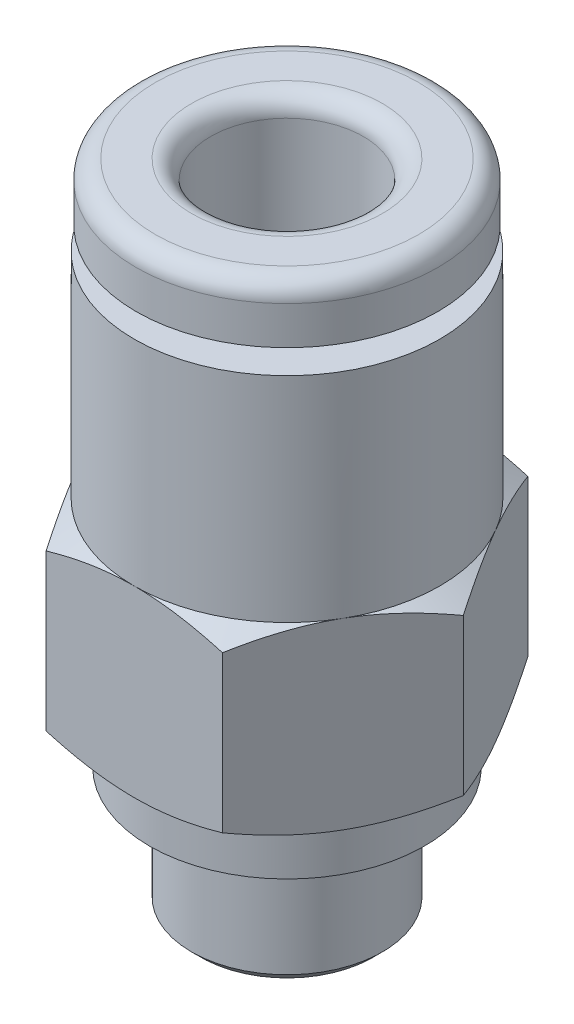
ISO-10303-21;
HEADER;
FILE_DESCRIPTION(('STEP AP214'),'2;1');
FILE_NAME('part.step','',(''),(''),'','','');
FILE_SCHEMA(('AUTOMOTIVE_DESIGN { 1 0 10303 214 1 1 1 1 }'));
ENDSEC;
DATA;
#1=APPLICATION_CONTEXT('core data for automotive mechanical design processes');
#2=APPLICATION_PROTOCOL_DEFINITION('international standard','automotive_design',2000,#1);
#3=PRODUCT_CONTEXT('',#1,'mechanical');
#4=PRODUCT('Part','Part','',(#3));
#5=PRODUCT_RELATED_PRODUCT_CATEGORY('part','',(#4));
#6=PRODUCT_DEFINITION_FORMATION('','',#4);
#7=PRODUCT_DEFINITION_CONTEXT('part definition',#1,'design');
#8=PRODUCT_DEFINITION('design','',#6,#7);
#9=PRODUCT_DEFINITION_SHAPE('','',#8);
#10=(LENGTH_UNIT() NAMED_UNIT(*) SI_UNIT(.MILLI.,.METRE.));
#11=(NAMED_UNIT(*) PLANE_ANGLE_UNIT() SI_UNIT($,.RADIAN.));
#12=(NAMED_UNIT(*) SI_UNIT($,.STERADIAN.) SOLID_ANGLE_UNIT());
#13=UNCERTAINTY_MEASURE_WITH_UNIT(LENGTH_MEASURE(1.E-05),#10,'distance_accuracy_value','');
#14=(GEOMETRIC_REPRESENTATION_CONTEXT(3) GLOBAL_UNCERTAINTY_ASSIGNED_CONTEXT((#13)) GLOBAL_UNIT_ASSIGNED_CONTEXT((#10,
#11,#12)) REPRESENTATION_CONTEXT('',''));
#15=CARTESIAN_POINT('',(0.,0.,0.));
#16=DIRECTION('',(0.,0.,1.));
#17=DIRECTION('',(1.,0.,0.));
#18=AXIS2_PLACEMENT_3D('',#15,#16,#17);
#19=CARTESIAN_POINT('',(0.,0.,0.));
#20=DIRECTION('',(0.,1.,0.));
#21=DIRECTION('',(0.,0.,1.));
#22=AXIS2_PLACEMENT_3D('',#19,#20,#21);
#23=CYLINDRICAL_SURFACE('',#22,2.2);
#24=CARTESIAN_POINT('',(0.,-2.10000000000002,0.));
#25=DIRECTION('',(0.,1.,0.));
#26=DIRECTION('',(0.,0.,1.));
#27=AXIS2_PLACEMENT_3D('',#24,#25,#26);
#28=CIRCLE('',#27,2.2);
#29=CARTESIAN_POINT('',(0.,-2.10000000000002,2.20000000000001));
#30=VERTEX_POINT('',#29);
#31=EDGE_CURVE('E245',#30,#30,#28,.F.);
#32=ORIENTED_EDGE('',*,*,#31,.F.);
#33=EDGE_LOOP('',(#32));
#34=FACE_BOUND('',#33,.T.);
#35=CARTESIAN_POINT('',(0.,-1.5,0.));
#36=DIRECTION('',(0.,1.,0.));
#37=DIRECTION('',(0.,0.,1.));
#38=AXIS2_PLACEMENT_3D('',#35,#36,#37);
#39=CIRCLE('',#38,2.2);
#40=CARTESIAN_POINT('',(0.,-1.5,2.20000000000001));
#41=VERTEX_POINT('',#40);
#42=EDGE_CURVE('E258',#41,#41,#39,.T.);
#43=ORIENTED_EDGE('',*,*,#42,.F.);
#44=EDGE_LOOP('',(#43));
#45=FACE_BOUND('',#44,.T.);
#46=ADVANCED_FACE('F29',(#34,#45),#23,.T.);
#47=CARTESIAN_POINT('',(-3.95,-1.5,0.));
#48=DIRECTION('',(0.,-1.,0.));
#49=DIRECTION('',(0.,0.,-1.));
#50=AXIS2_PLACEMENT_3D('',#47,#48,#49);
#51=PLANE('',#50);
#52=ORIENTED_EDGE('',*,*,#42,.T.);
#53=EDGE_LOOP('',(#52));
#54=FACE_BOUND('',#53,.T.);
#55=CARTESIAN_POINT('',(0.,-1.5,0.));
#56=DIRECTION('',(0.,1.,0.));
#57=DIRECTION('',(0.,0.,1.));
#58=AXIS2_PLACEMENT_3D('',#55,#56,#57);
#59=CIRCLE('',#58,3.95);
#60=CARTESIAN_POINT('',(0.,-1.5,3.95000000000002));
#61=VERTEX_POINT('',#60);
#62=EDGE_CURVE('E255',#61,#61,#59,.T.);
#63=ORIENTED_EDGE('',*,*,#62,.F.);
#64=EDGE_LOOP('',(#63));
#65=FACE_BOUND('',#64,.T.);
#66=ADVANCED_FACE('F353',(#54,#65),#51,.T.);
#67=CARTESIAN_POINT('',(0.,0.,0.));
#68=DIRECTION('',(0.,1.,0.));
#69=DIRECTION('',(0.,0.,1.));
#70=AXIS2_PLACEMENT_3D('',#67,#68,#69);
#71=CYLINDRICAL_SURFACE('',#70,3.95);
#72=ORIENTED_EDGE('',*,*,#62,.T.);
#73=EDGE_LOOP('',(#72));
#74=FACE_BOUND('',#73,.T.);
#75=CARTESIAN_POINT('',(0.,-0.5,0.));
#76=DIRECTION('',(0.,1.,0.));
#77=DIRECTION('',(0.,0.,1.));
#78=AXIS2_PLACEMENT_3D('',#75,#76,#77);
#79=CIRCLE('',#78,3.95);
#80=CARTESIAN_POINT('',(0.,-0.5,3.95000000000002));
#81=VERTEX_POINT('',#80);
#82=EDGE_CURVE('E252',#81,#81,#79,.T.);
#83=ORIENTED_EDGE('',*,*,#82,.F.);
#84=EDGE_LOOP('',(#83));
#85=FACE_BOUND('',#84,.T.);
#86=ADVANCED_FACE('F358',(#74,#85),#71,.T.);
#87=CARTESIAN_POINT('',(0.,-0.5,0.));
#88=DIRECTION('',(0.,1.,0.));
#89=DIRECTION('',(0.,0.,1.));
#90=AXIS2_PLACEMENT_3D('',#87,#88,#89);
#91=TOROIDAL_SURFACE('',#90,3.45,0.5);
#92=ORIENTED_EDGE('',*,*,#82,.T.);
#93=EDGE_LOOP('',(#92));
#94=FACE_BOUND('',#93,.T.);
#95=CARTESIAN_POINT('',(0.,0.,0.));
#96=DIRECTION('',(0.,1.,0.));
#97=DIRECTION('',(0.,0.,1.));
#98=AXIS2_PLACEMENT_3D('',#95,#96,#97);
#99=CIRCLE('',#98,3.45);
#100=CARTESIAN_POINT('',(0.,0.,3.45000000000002));
#101=VERTEX_POINT('',#100);
#102=EDGE_CURVE('E249',#101,#101,#99,.T.);
#103=ORIENTED_EDGE('',*,*,#102,.F.);
#104=EDGE_LOOP('',(#103));
#105=FACE_BOUND('',#104,.T.);
#106=ADVANCED_FACE('F368',(#94,#105),#91,.T.);
#107=CARTESIAN_POINT('',(0.,0.,0.));
#108=DIRECTION('',(0.,1.,0.));
#109=DIRECTION('',(0.,0.,1.));
#110=AXIS2_PLACEMENT_3D('',#107,#108,#109);
#111=PLANE('',#110);
#112=CARTESIAN_POINT('',(0.,0.,0.));
#113=DIRECTION('',(0.,1.,0.));
#114=DIRECTION('',(0.,0.,1.));
#115=AXIS2_PLACEMENT_3D('',#112,#113,#114);
#116=CIRCLE('',#115,2.5);
#117=CARTESIAN_POINT('',(0.,0.,2.50000000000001));
#118=VERTEX_POINT('',#117);
#119=EDGE_CURVE('E11',#118,#118,#116,.F.);
#120=ORIENTED_EDGE('',*,*,#119,.T.);
#121=EDGE_LOOP('',(#120));
#122=FACE_BOUND('',#121,.T.);
#123=ORIENTED_EDGE('',*,*,#102,.T.);
#124=EDGE_LOOP('',(#123));
#125=FACE_BOUND('',#124,.T.);
#126=ADVANCED_FACE('F374',(#122,#125),#111,.T.);
#127=CARTESIAN_POINT('',(0.,-19.0137084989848,0.));
#128=DIRECTION('',(0.,1.,0.));
#129=DIRECTION('',(0.,0.,1.));
#130=AXIS2_PLACEMENT_3D('',#127,#128,#129);
#131=CYLINDRICAL_SURFACE('',#130,4.);
#132=CARTESIAN_POINT('',(0.,-7.70000000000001,0.));
#133=DIRECTION('',(0.,1.,0.));
#134=DIRECTION('',(0.,0.,1.));
#135=AXIS2_PLACEMENT_3D('',#132,#133,#134);
#136=CIRCLE('',#135,4.);
#137=CARTESIAN_POINT('',(0.,-7.70000000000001,3.99999999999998));
#138=VERTEX_POINT('',#137);
#139=CARTESIAN_POINT('',(-3.46410161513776,-7.70000000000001,2.00000000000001));
#140=VERTEX_POINT('',#139);
#141=EDGE_CURVE('E243',#138,#140,#136,.F.);
#142=ORIENTED_EDGE('',*,*,#141,.F.);
#143=CARTESIAN_POINT('',(3.46410161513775,-7.70000000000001,2.00000000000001));
#144=VERTEX_POINT('',#143);
#145=EDGE_CURVE('E242',#144,#138,#136,.F.);
#146=ORIENTED_EDGE('',*,*,#145,.F.);
#147=CARTESIAN_POINT('',(3.46410161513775,-7.70000000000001,-2.));
#148=VERTEX_POINT('',#147);
#149=EDGE_CURVE('E317',#148,#144,#136,.F.);
#150=ORIENTED_EDGE('',*,*,#149,.F.);
#151=CARTESIAN_POINT('',(0.,-7.70000000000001,-4.00000000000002));
#152=VERTEX_POINT('',#151);
#153=EDGE_CURVE('E322',#152,#148,#136,.F.);
#154=ORIENTED_EDGE('',*,*,#153,.F.);
#155=CARTESIAN_POINT('',(-3.46410161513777,-7.70000000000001,-2.00000000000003));
#156=VERTEX_POINT('',#155);
#157=EDGE_CURVE('E464',#156,#152,#136,.F.);
#158=ORIENTED_EDGE('',*,*,#157,.F.);
#159=EDGE_CURVE('E246',#140,#156,#136,.F.);
#160=ORIENTED_EDGE('',*,*,#159,.F.);
#161=EDGE_LOOP('',(#142,#146,#150,#154,#158,#160));
#162=FACE_BOUND('',#161,.T.);
#163=CARTESIAN_POINT('',(0.,-2.10000000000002,0.));
#164=DIRECTION('',(0.,1.,0.));
#165=DIRECTION('',(0.,0.,1.));
#166=AXIS2_PLACEMENT_3D('',#163,#164,#165);
#167=CIRCLE('',#166,4.);
#168=CARTESIAN_POINT('',(0.,-2.10000000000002,4.00000000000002));
#169=VERTEX_POINT('',#168);
#170=EDGE_CURVE('E230',#169,#169,#167,.T.);
#171=ORIENTED_EDGE('',*,*,#170,.F.);
#172=EDGE_LOOP('',(#171));
#173=FACE_BOUND('',#172,.T.);
#174=ADVANCED_FACE('F324',(#162,#173),#131,.T.);
#175=CARTESIAN_POINT('',(0.,-2.10000000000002,0.));
#176=DIRECTION('',(0.,1.,0.));
#177=DIRECTION('',(0.,0.,1.));
#178=AXIS2_PLACEMENT_3D('',#175,#176,#177);
#179=PLANE('',#178);
#180=ORIENTED_EDGE('',*,*,#31,.T.);
#181=EDGE_LOOP('',(#180));
#182=FACE_BOUND('',#181,.T.);
#183=ORIENTED_EDGE('',*,*,#170,.T.);
#184=EDGE_LOOP('',(#183));
#185=FACE_BOUND('',#184,.T.);
#186=ADVANCED_FACE('F278',(#182,#185),#179,.T.);
#187=CARTESIAN_POINT('',(0.,-9.4320508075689,0.));
#188=DIRECTION('',(0.,-1.,0.));
#189=DIRECTION('',(0.,0.,-1.));
#190=AXIS2_PLACEMENT_3D('',#187,#188,#189);
#191=CONICAL_SURFACE('',#190,7.,1.0471975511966);
#192=CARTESIAN_POINT('',(-2.30928560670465,-8.05733225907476,-4.0002));
#193=CARTESIAN_POINT('',(-2.41077174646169,-7.99871787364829,-3.82442084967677));
#194=CARTESIAN_POINT('',(-2.51313390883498,-7.94541032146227,-3.64712438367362));
#195=CARTESIAN_POINT('',(-2.7196307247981,-7.85236167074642,-3.28946140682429));
#196=CARTESIAN_POINT('',(-2.82376904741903,-7.81265348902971,-3.10908854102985));
#197=CARTESIAN_POINT('',(-3.03075510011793,-7.75084221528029,-2.75057818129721));
#198=CARTESIAN_POINT('',(-3.13357098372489,-7.7283277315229,-2.57249584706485));
#199=CARTESIAN_POINT('',(-3.33968651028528,-7.70145062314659,-2.2154932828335));
#200=CARTESIAN_POINT('',(-3.44298540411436,-7.69706574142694,-2.03657435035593));
#201=CARTESIAN_POINT('',(-3.63600352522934,-7.70619007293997,-1.70225715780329));
#202=CARTESIAN_POINT('',(-3.72575165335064,-7.717458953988,-1.54680884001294));
#203=CARTESIAN_POINT('',(-3.90466320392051,-7.7531739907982,-1.23692494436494));
#204=CARTESIAN_POINT('',(-3.99382600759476,-7.77763234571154,-1.08249043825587));
#205=CARTESIAN_POINT('',(-4.17310641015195,-7.83877606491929,-0.771967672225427));
#206=CARTESIAN_POINT('',(-4.26320131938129,-7.87572060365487,-0.615918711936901));
#207=CARTESIAN_POINT('',(-4.44204742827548,-7.95957007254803,-0.306148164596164));
#208=CARTESIAN_POINT('',(-4.53080091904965,-8.00645530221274,-0.152422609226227));
#209=CARTESIAN_POINT('',(-4.61891762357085,-8.05733225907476,0.000199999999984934));
#210=B_SPLINE_CURVE_WITH_KNOTS('',3,(#192,#193,#194,#195,#196,#197,#198,#199,#200,#201,#202,
#203,#204,#205,#206,#207,#208,#209),.UNSPECIFIED.,.F.,.F.,(4,2,2,2,2,2,2,2,4),(0.,
0.634047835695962,1.26961969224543,1.88946157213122,2.50854226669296,3.04757825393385,
3.58711366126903,4.13861653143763,4.68903648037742),.UNSPECIFIED.);
#211=CARTESIAN_POINT('',(-2.30940107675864,-8.05726558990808,-4.00000000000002));
#212=VERTEX_POINT('',#211);
#213=EDGE_CURVE('E288',#212,#156,#210,.T.);
#214=ORIENTED_EDGE('',*,*,#213,.T.);
#215=ORIENTED_EDGE('',*,*,#157,.T.);
#216=CARTESIAN_POINT('',(-6.31761832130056,-9.70770834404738,-3.99999999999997));
#217=CARTESIAN_POINT('',(-6.14192520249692,-9.62202819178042,-4.00000000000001));
#218=CARTESIAN_POINT('',(-5.96584084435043,-9.53713714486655,-4.00000000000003));
#219=CARTESIAN_POINT('',(-5.61268201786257,-9.36937488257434,-4.00000000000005));
#220=CARTESIAN_POINT('',(-5.43560740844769,-9.28650396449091,-4.00000000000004));
#221=CARTESIAN_POINT('',(-5.07940162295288,-9.12283072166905,-4.00000000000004));
#222=CARTESIAN_POINT('',(-4.9002645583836,-9.04204116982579,-4.00000000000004));
#223=CARTESIAN_POINT('',(-4.54060511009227,-8.88361887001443,-4.00000000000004));
#224=CARTESIAN_POINT('',(-4.36008278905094,-8.80598598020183,-4.00000000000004));
#225=CARTESIAN_POINT('',(-3.99110781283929,-8.65209649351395,-4.00000000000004));
#226=CARTESIAN_POINT('',(-3.80259647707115,-8.57597985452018,-4.00000000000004));
#227=CARTESIAN_POINT('',(-3.42341084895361,-8.42923550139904,-4.00000000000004));
#228=CARTESIAN_POINT('',(-3.23273632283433,-8.35860838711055,-4.00000000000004));
#229=CARTESIAN_POINT('',(-2.84924251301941,-8.22461400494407,-4.00000000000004));
#230=CARTESIAN_POINT('',(-2.65642808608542,-8.16123297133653,-4.00000000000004));
#231=CARTESIAN_POINT('',(-2.26803531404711,-8.04368868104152,-4.00000000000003));
#232=CARTESIAN_POINT('',(-2.07245782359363,-7.98952263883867,-4.00000000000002));
#233=CARTESIAN_POINT('',(-1.6795415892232,-7.893227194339,-4.00000000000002));
#234=CARTESIAN_POINT('',(-1.48222021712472,-7.8510281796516,-4.00000000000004));
#235=CARTESIAN_POINT('',(-1.08500777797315,-7.78096546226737,-4.00000000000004));
#236=CARTESIAN_POINT('',(-0.885116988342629,-7.75310022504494,-4.00000000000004));
#237=CARTESIAN_POINT('',(-0.486419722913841,-7.71428669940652,-4.00000000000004));
#238=CARTESIAN_POINT('',(-0.287635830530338,-7.70311216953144,-4.00000000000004));
#239=CARTESIAN_POINT('',(0.110173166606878,-7.69802409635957,-4.00000000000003));
#240=CARTESIAN_POINT('',(0.309198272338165,-7.70411062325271,-4.00000000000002));
#241=CARTESIAN_POINT('',(0.643785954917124,-7.72841179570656,-4.00000000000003));
#242=CARTESIAN_POINT('',(0.779690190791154,-7.74222784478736,-4.00000000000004));
#243=CARTESIAN_POINT('',(1.05057142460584,-7.77710808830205,-4.00000000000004));
#244=CARTESIAN_POINT('',(1.18554830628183,-7.79817317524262,-4.00000000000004));
#245=CARTESIAN_POINT('',(1.58887088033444,-7.87114189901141,-4.00000000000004));
#246=CARTESIAN_POINT('',(1.85547379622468,-7.93280785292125,-4.00000000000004));
#247=CARTESIAN_POINT('',(2.25427403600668,-8.04059912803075,-4.00000000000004));
#248=CARTESIAN_POINT('',(2.38851478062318,-8.07960281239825,-4.00000000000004));
#249=CARTESIAN_POINT('',(2.65569482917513,-8.16187740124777,-4.00000000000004));
#250=CARTESIAN_POINT('',(2.78863412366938,-8.20514833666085,-4.00000000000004));
#251=CARTESIAN_POINT('',(3.05324930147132,-8.29524531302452,-4.00000000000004));
#252=CARTESIAN_POINT('',(3.18492553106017,-8.34207034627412,-4.00000000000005));
#253=CARTESIAN_POINT('',(3.44717271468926,-8.43870323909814,-4.00000000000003));
#254=CARTESIAN_POINT('',(3.57774368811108,-8.48851104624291,-4.));
#255=CARTESIAN_POINT('',(3.90838583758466,-8.61828112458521,-3.99999999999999));
#256=CARTESIAN_POINT('',(4.10778247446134,-8.69995980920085,-4.00000000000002));
#257=CARTESIAN_POINT('',(4.50466534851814,-8.86784881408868,-4.00000000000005));
#258=CARTESIAN_POINT('',(4.70215141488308,-8.95405953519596,-4.00000000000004));
#259=CARTESIAN_POINT('',(5.09560571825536,-9.13001548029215,-4.00000000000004));
#260=CARTESIAN_POINT('',(5.29157350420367,-9.21976170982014,-4.00000000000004));
#261=CARTESIAN_POINT('',(5.68222178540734,-9.40201823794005,-4.00000000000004));
#262=CARTESIAN_POINT('',(5.87690224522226,-9.49452861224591,-4.00000000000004));
#263=CARTESIAN_POINT('',(6.45989965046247,-9.77558165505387,-4.00000000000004));
#264=CARTESIAN_POINT('',(6.84663497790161,-9.96740176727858,-4.00000000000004));
#265=CARTESIAN_POINT('',(7.61714397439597,-10.3566974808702,-4.00000000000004));
#266=CARTESIAN_POINT('',(8.00091813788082,-10.5541721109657,-4.00000000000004));
#267=CARTESIAN_POINT('',(8.72975807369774,-10.9339590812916,-4.00000000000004));
#268=CARTESIAN_POINT('',(9.07501124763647,-11.1159124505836,-4.00000000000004));
#269=CARTESIAN_POINT('',(9.76427122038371,-11.4822021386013,-4.00000000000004));
#270=CARTESIAN_POINT('',(10.1082779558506,-11.6665385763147,-4.00000000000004));
#271=CARTESIAN_POINT('',(10.7942722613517,-12.0364316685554,-4.00000000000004));
#272=CARTESIAN_POINT('',(11.1362627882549,-12.2219828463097,-4.00000000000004));
#273=CARTESIAN_POINT('',(11.819458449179,-12.5944698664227,-4.00000000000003));
#274=CARTESIAN_POINT('',(12.1606636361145,-12.7814056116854,-4.00000000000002));
#275=CARTESIAN_POINT('',(12.5015869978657,-12.9688502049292,-4.));
#276=B_SPLINE_CURVE_WITH_KNOTS('',3,(#216,#217,#218,#219,#220,#221,#222,#223,#224,#225,#226,
#227,#228,#229,#230,#231,#232,#233,#234,#235,#236,#237,#238,#239,#240,#241,#242,#243,#244,#245,
#246,#247,#248,#249,#250,#251,#252,#253,#254,#255,#256,#257,#258,#259,#260,#261,#262,#263,#264,
#265,#266,#267,#268,#269,#270,#271,#272,#273,#274,#275),.UNSPECIFIED.,.F.,.F.,(4,2,2,2,2,2,2,2,
2,2,2,2,2,2,2,2,2,2,2,2,2,2,2,2,2,2,2,2,2,4),(0.,0.586421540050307,1.17292886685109,
1.76244097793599,2.3519265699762,2.96175582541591,3.57165162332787,4.18036881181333,
4.7889016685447,5.39381845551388,5.99867046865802,6.59524689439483,7.19182574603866,
7.60144321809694,8.0111111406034,8.83085062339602,9.25018861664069,9.66952964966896,
10.0887522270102,10.5079674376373,11.1543192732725,11.8007283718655,12.4473226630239,
13.0939346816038,14.3889300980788,15.6837043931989,16.8544868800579,18.0253280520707,
19.1925780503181,20.3597469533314),.UNSPECIFIED.);
#277=EDGE_CURVE('E260',#152,#212,#276,.F.);
#278=ORIENTED_EDGE('',*,*,#277,.T.);
#279=EDGE_LOOP('',(#214,#215,#278));
#280=FACE_BOUND('',#279,.T.);
#281=ADVANCED_FACE('F175',(#280),#191,.T.);
#282=CARTESIAN_POINT('',(4.61891762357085,-8.05733225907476,0.00020000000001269));
#283=CARTESIAN_POINT('',(4.51743148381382,-7.9987178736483,-0.175579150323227));
#284=CARTESIAN_POINT('',(4.41506932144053,-7.94541032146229,-0.352875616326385));
#285=CARTESIAN_POINT('',(4.20857250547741,-7.85236167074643,-0.710538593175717));
#286=CARTESIAN_POINT('',(4.10443418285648,-7.81265348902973,-0.890911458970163));
#287=CARTESIAN_POINT('',(3.89744813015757,-7.7508422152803,-1.2494218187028));
#288=CARTESIAN_POINT('',(3.7946322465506,-7.72832773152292,-1.42750415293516));
#289=CARTESIAN_POINT('',(3.58851671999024,-7.7014506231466,-1.78450671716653));
#290=CARTESIAN_POINT('',(3.48521782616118,-7.69706574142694,-1.96342564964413));
#291=CARTESIAN_POINT('',(3.2921997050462,-7.70619007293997,-2.29774284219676));
#292=CARTESIAN_POINT('',(3.20245157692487,-7.71745895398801,-2.45319115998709));
#293=CARTESIAN_POINT('',(3.02354002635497,-7.75317399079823,-2.76307505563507));
#294=CARTESIAN_POINT('',(2.93437722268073,-7.77763234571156,-2.91750956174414));
#295=CARTESIAN_POINT('',(2.75509682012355,-7.83877606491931,-3.22803232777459));
#296=CARTESIAN_POINT('',(2.66500191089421,-7.87572060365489,-3.38408128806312));
#297=CARTESIAN_POINT('',(2.48615580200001,-7.95957007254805,-3.69385183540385));
#298=CARTESIAN_POINT('',(2.39740231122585,-8.00645530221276,-3.84757739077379));
#299=CARTESIAN_POINT('',(2.30928560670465,-8.05733225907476,-4.0002));
#300=B_SPLINE_CURVE_WITH_KNOTS('',3,(#282,#283,#284,#285,#286,#287,#288,#289,#290,#291,#292,
#293,#294,#295,#296,#297,#298,#299),.UNSPECIFIED.,.F.,.F.,(4,2,2,2,2,2,2,2,4),(0.,
0.634047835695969,1.26961969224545,1.88946157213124,2.50854226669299,3.04757825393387,
3.58711366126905,4.13861653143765,4.68903648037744),.UNSPECIFIED.);
#301=CARTESIAN_POINT('',(2.30940107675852,-8.05726558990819,-4.00000000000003));
#302=VERTEX_POINT('',#301);
#303=EDGE_CURVE('E282',#148,#302,#300,.T.);
#304=ORIENTED_EDGE('',*,*,#303,.T.);
#305=EDGE_CURVE('E265',#302,#152,#276,.F.);
#306=ORIENTED_EDGE('',*,*,#305,.T.);
#307=ORIENTED_EDGE('',*,*,#153,.T.);
#308=EDGE_LOOP('',(#304,#306,#307));
#309=FACE_BOUND('',#308,.T.);
#310=ADVANCED_FACE('F461',(#309),#191,.T.);
#311=CARTESIAN_POINT('',(-4.61891762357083,-8.05733225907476,-0.000199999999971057));
#312=CARTESIAN_POINT('',(-4.51743148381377,-7.99871787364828,0.175579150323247));
#313=CARTESIAN_POINT('',(-4.41506932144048,-7.94541032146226,0.352875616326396));
#314=CARTESIAN_POINT('',(-4.20857250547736,-7.8523616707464,0.710538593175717));
#315=CARTESIAN_POINT('',(-4.10443418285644,-7.8126534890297,0.89091145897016));
#316=CARTESIAN_POINT('',(-3.89744813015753,-7.75084221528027,1.24942181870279));
#317=CARTESIAN_POINT('',(-3.79463224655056,-7.72832773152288,1.42750415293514));
#318=CARTESIAN_POINT('',(-3.58851671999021,-7.70145062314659,1.78450671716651));
#319=CARTESIAN_POINT('',(-3.48521782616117,-7.69706574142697,1.96342564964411));
#320=CARTESIAN_POINT('',(-3.29219970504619,-7.70619007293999,2.29774284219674));
#321=CARTESIAN_POINT('',(-3.20245157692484,-7.717458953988,2.45319115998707));
#322=CARTESIAN_POINT('',(-3.02354002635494,-7.75317399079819,2.76307505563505));
#323=CARTESIAN_POINT('',(-2.9343772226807,-7.77763234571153,2.91750956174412));
#324=CARTESIAN_POINT('',(-2.75509682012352,-7.83877606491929,3.22803232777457));
#325=CARTESIAN_POINT('',(-2.66500191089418,-7.87572060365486,3.38408128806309));
#326=CARTESIAN_POINT('',(-2.48615580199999,-7.95957007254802,3.69385183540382));
#327=CARTESIAN_POINT('',(-2.39740231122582,-8.00645530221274,3.84757739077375));
#328=CARTESIAN_POINT('',(-2.30928560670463,-8.05733225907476,4.00019999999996));
#329=B_SPLINE_CURVE_WITH_KNOTS('',3,(#311,#312,#313,#314,#315,#316,#317,#318,#319,#320,#321,
#322,#323,#324,#325,#326,#327,#328),.UNSPECIFIED.,.F.,.F.,(4,2,2,2,2,2,2,2,4),(0.,
0.634047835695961,1.26961969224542,1.8894615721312,2.50854226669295,3.04757825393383,
3.587113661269,4.13861653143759,4.68903648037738),.UNSPECIFIED.);
#330=CARTESIAN_POINT('',(-4.618802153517,-8.05726558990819,0.));
#331=VERTEX_POINT('',#330);
#332=EDGE_CURVE('E292',#331,#140,#329,.T.);
#333=ORIENTED_EDGE('',*,*,#332,.T.);
#334=ORIENTED_EDGE('',*,*,#159,.T.);
#335=EDGE_CURVE('E297',#156,#331,#210,.T.);
#336=ORIENTED_EDGE('',*,*,#335,.T.);
#337=EDGE_LOOP('',(#333,#334,#336));
#338=FACE_BOUND('',#337,.T.);
#339=ADVANCED_FACE('F466',(#338),#191,.T.);
#340=CARTESIAN_POINT('',(-6.31761832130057,-9.70770834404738,4.00000000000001));
#341=CARTESIAN_POINT('',(-6.14192520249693,-9.62202819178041,3.99999999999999));
#342=CARTESIAN_POINT('',(-5.96584084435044,-9.53713714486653,3.99999999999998));
#343=CARTESIAN_POINT('',(-5.61268201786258,-9.36937488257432,3.99999999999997));
#344=CARTESIAN_POINT('',(-5.4356074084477,-9.28650396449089,3.99999999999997));
#345=CARTESIAN_POINT('',(-5.07940162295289,-9.12283072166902,3.99999999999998));
#346=CARTESIAN_POINT('',(-4.9002645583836,-9.04204116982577,3.99999999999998));
#347=CARTESIAN_POINT('',(-4.54060511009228,-8.8836188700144,3.99999999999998));
#348=CARTESIAN_POINT('',(-4.36008278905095,-8.8059859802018,3.99999999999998));
#349=CARTESIAN_POINT('',(-3.9911078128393,-8.65209649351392,3.99999999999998));
#350=CARTESIAN_POINT('',(-3.80259647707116,-8.57597985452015,3.99999999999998));
#351=CARTESIAN_POINT('',(-3.42341084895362,-8.42923550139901,3.99999999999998));
#352=CARTESIAN_POINT('',(-3.23273632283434,-8.35860838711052,3.99999999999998));
#353=CARTESIAN_POINT('',(-2.84924251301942,-8.22461400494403,3.99999999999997));
#354=CARTESIAN_POINT('',(-2.65642808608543,-8.16123297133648,3.99999999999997));
#355=CARTESIAN_POINT('',(-2.26803531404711,-8.0436886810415,3.99999999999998));
#356=CARTESIAN_POINT('',(-2.07245782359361,-7.98952263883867,3.99999999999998));
#357=CARTESIAN_POINT('',(-1.67954158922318,-7.893227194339,3.99999999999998));
#358=CARTESIAN_POINT('',(-1.48222021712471,-7.85102817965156,3.99999999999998));
#359=CARTESIAN_POINT('',(-1.08500777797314,-7.78096546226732,3.99999999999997));
#360=CARTESIAN_POINT('',(-0.88511698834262,-7.7531002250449,3.99999999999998));
#361=CARTESIAN_POINT('',(-0.48641972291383,-7.71428669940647,3.99999999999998));
#362=CARTESIAN_POINT('',(-0.287635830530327,-7.70311216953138,3.99999999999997));
#363=CARTESIAN_POINT('',(0.110173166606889,-7.69802409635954,3.99999999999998));
#364=CARTESIAN_POINT('',(0.309198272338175,-7.70411062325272,3.99999999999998));
#365=CARTESIAN_POINT('',(0.64378595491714,-7.72841179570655,3.99999999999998));
#366=CARTESIAN_POINT('',(0.779690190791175,-7.74222784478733,3.99999999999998));
#367=CARTESIAN_POINT('',(1.05057142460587,-7.777108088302,3.99999999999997));
#368=CARTESIAN_POINT('',(1.18554830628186,-7.79817317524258,3.99999999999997));
#369=CARTESIAN_POINT('',(1.58887088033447,-7.87114189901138,3.99999999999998));
#370=CARTESIAN_POINT('',(1.85547379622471,-7.93280785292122,3.99999999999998));
#371=CARTESIAN_POINT('',(2.25427403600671,-8.04059912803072,3.99999999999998));
#372=CARTESIAN_POINT('',(2.38851478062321,-8.07960281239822,3.99999999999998));
#373=CARTESIAN_POINT('',(2.65569482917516,-8.16187740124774,3.99999999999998));
#374=CARTESIAN_POINT('',(2.7886341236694,-8.20514833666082,3.99999999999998));
#375=CARTESIAN_POINT('',(3.05324930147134,-8.29524531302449,3.99999999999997));
#376=CARTESIAN_POINT('',(3.1849255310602,-8.34207034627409,3.99999999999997));
#377=CARTESIAN_POINT('',(3.44717271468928,-8.43870323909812,3.99999999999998));
#378=CARTESIAN_POINT('',(3.5777436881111,-8.48851104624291,3.99999999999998));
#379=CARTESIAN_POINT('',(3.90838583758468,-8.61828112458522,3.99999999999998));
#380=CARTESIAN_POINT('',(4.10778247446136,-8.69995980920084,3.99999999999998));
#381=CARTESIAN_POINT('',(4.50466534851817,-8.86784881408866,3.99999999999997));
#382=CARTESIAN_POINT('',(4.70215141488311,-8.95405953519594,3.99999999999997));
#383=CARTESIAN_POINT('',(5.09560571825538,-9.13001548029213,3.99999999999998));
#384=CARTESIAN_POINT('',(5.29157350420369,-9.21976170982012,3.99999999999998));
#385=CARTESIAN_POINT('',(5.68222178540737,-9.40201823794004,3.99999999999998));
#386=CARTESIAN_POINT('',(5.87690224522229,-9.4945286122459,3.99999999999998));
#387=CARTESIAN_POINT('',(6.45989965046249,-9.77558165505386,3.99999999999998));
#388=CARTESIAN_POINT('',(6.84663497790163,-9.96740176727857,3.99999999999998));
#389=CARTESIAN_POINT('',(7.61714397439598,-10.3566974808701,3.99999999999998));
#390=CARTESIAN_POINT('',(8.00091813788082,-10.5541721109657,3.99999999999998));
#391=CARTESIAN_POINT('',(8.72975807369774,-10.9339590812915,3.99999999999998));
#392=CARTESIAN_POINT('',(9.07501124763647,-11.1159124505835,3.99999999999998));
#393=CARTESIAN_POINT('',(9.7642712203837,-11.4822021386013,3.99999999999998));
#394=CARTESIAN_POINT('',(10.1082779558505,-11.6665385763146,3.99999999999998));
#395=CARTESIAN_POINT('',(10.7942722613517,-12.0364316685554,3.99999999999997));
#396=CARTESIAN_POINT('',(11.1362627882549,-12.2219828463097,3.99999999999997));
#397=CARTESIAN_POINT('',(11.819458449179,-12.5944698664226,3.99999999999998));
#398=CARTESIAN_POINT('',(12.1606636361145,-12.7814056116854,3.99999999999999));
#399=CARTESIAN_POINT('',(12.5015869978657,-12.9688502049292,4.00000000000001));
#400=B_SPLINE_CURVE_WITH_KNOTS('',3,(#340,#341,#342,#343,#344,#345,#346,#347,#348,#349,#350,
#351,#352,#353,#354,#355,#356,#357,#358,#359,#360,#361,#362,#363,#364,#365,#366,#367,#368,#369,
#370,#371,#372,#373,#374,#375,#376,#377,#378,#379,#380,#381,#382,#383,#384,#385,#386,#387,#388,
#389,#390,#391,#392,#393,#394,#395,#396,#397,#398,#399),.UNSPECIFIED.,.F.,.F.,(4,2,2,2,2,2,2,2,
2,2,2,2,2,2,2,2,2,2,2,2,2,2,2,2,2,2,2,2,2,4),(0.,0.586421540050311,1.1729288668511,
1.762440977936,2.35192656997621,2.96175582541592,3.57165162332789,4.18036881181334,
4.78890166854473,5.39381845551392,5.99867046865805,6.59524689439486,7.1918257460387,
7.60144321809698,8.01111114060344,8.83085062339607,9.25018861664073,9.669529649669,
10.0887522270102,10.5079674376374,11.1543192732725,11.8007283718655,12.447322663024,
13.0939346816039,14.3889300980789,15.683704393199,16.8544868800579,18.0253280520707,
19.1925780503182,20.3597469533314),.UNSPECIFIED.);
#401=CARTESIAN_POINT('',(-2.30940107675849,-8.05726558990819,4.00000000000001));
#402=VERTEX_POINT('',#401);
#403=EDGE_CURVE('E221',#402,#138,#400,.T.);
#404=ORIENTED_EDGE('',*,*,#403,.T.);
#405=ORIENTED_EDGE('',*,*,#141,.T.);
#406=EDGE_CURVE('E222',#140,#402,#329,.T.);
#407=ORIENTED_EDGE('',*,*,#406,.T.);
#408=EDGE_LOOP('',(#404,#405,#407));
#409=FACE_BOUND('',#408,.T.);
#410=ADVANCED_FACE('F328',(#409),#191,.T.);
#411=CARTESIAN_POINT('',(2.30940107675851,-8.05726558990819,4.00000000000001));
#412=VERTEX_POINT('',#411);
#413=EDGE_CURVE('E214',#138,#412,#400,.T.);
#414=ORIENTED_EDGE('',*,*,#413,.T.);
#415=CARTESIAN_POINT('',(2.30928560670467,-8.05733225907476,4.00019999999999));
#416=CARTESIAN_POINT('',(2.41077174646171,-7.99871787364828,3.82442084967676));
#417=CARTESIAN_POINT('',(2.513133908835,-7.94541032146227,3.6471243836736));
#418=CARTESIAN_POINT('',(2.71963072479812,-7.85236167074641,3.28946140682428));
#419=CARTESIAN_POINT('',(2.82376904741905,-7.81265348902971,3.10908854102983));
#420=CARTESIAN_POINT('',(3.03075510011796,-7.75084221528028,2.75057818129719));
#421=CARTESIAN_POINT('',(3.13357098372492,-7.72832773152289,2.57249584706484));
#422=CARTESIAN_POINT('',(3.33968651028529,-7.70145062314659,2.21549328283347));
#423=CARTESIAN_POINT('',(3.44298540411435,-7.69706574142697,2.03657435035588));
#424=CARTESIAN_POINT('',(3.63600352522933,-7.70619007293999,1.70225715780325));
#425=CARTESIAN_POINT('',(3.72575165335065,-7.71745895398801,1.54680884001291));
#426=CARTESIAN_POINT('',(3.90466320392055,-7.7531739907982,1.23692494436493));
#427=CARTESIAN_POINT('',(3.99382600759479,-7.77763234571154,1.08249043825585));
#428=CARTESIAN_POINT('',(4.17310641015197,-7.8387760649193,0.771967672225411));
#429=CARTESIAN_POINT('',(4.26320131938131,-7.87572060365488,0.615918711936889));
#430=CARTESIAN_POINT('',(4.4420474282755,-7.95957007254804,0.306148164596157));
#431=CARTESIAN_POINT('',(4.53080091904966,-8.00645530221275,0.15242260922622));
#432=CARTESIAN_POINT('',(4.61891762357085,-8.05733225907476,-0.000199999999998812));
#433=B_SPLINE_CURVE_WITH_KNOTS('',3,(#415,#416,#417,#418,#419,#420,#421,#422,#423,#424,#425,
#426,#427,#428,#429,#430,#431,#432),.UNSPECIFIED.,.F.,.F.,(4,2,2,2,2,2,2,2,4),(0.,
0.634047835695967,1.26961969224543,1.88946157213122,2.50854226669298,3.04757825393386,
3.58711366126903,4.13861653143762,4.68903648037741),.UNSPECIFIED.);
#434=EDGE_CURVE('E303',#412,#144,#433,.T.);
#435=ORIENTED_EDGE('',*,*,#434,.T.);
#436=ORIENTED_EDGE('',*,*,#145,.T.);
#437=EDGE_LOOP('',(#414,#435,#436));
#438=FACE_BOUND('',#437,.T.);
#439=ADVANCED_FACE('F311',(#438),#191,.T.);
#440=CARTESIAN_POINT('',(4.61880215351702,-8.05726558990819,0.));
#441=VERTEX_POINT('',#440);
#442=EDGE_CURVE('E223',#144,#441,#433,.T.);
#443=ORIENTED_EDGE('',*,*,#442,.T.);
#444=EDGE_CURVE('E287',#441,#148,#300,.T.);
#445=ORIENTED_EDGE('',*,*,#444,.T.);
#446=ORIENTED_EDGE('',*,*,#149,.T.);
#447=EDGE_LOOP('',(#443,#445,#446));
#448=FACE_BOUND('',#447,.T.);
#449=ADVANCED_FACE('F270',(#448),#191,.T.);
#450=CARTESIAN_POINT('',(2.30940107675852,-24.7202018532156,-4.00000000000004));
#451=DIRECTION('',(0.,0.,-1.));
#452=DIRECTION('',(-1.,0.,0.));
#453=AXIS2_PLACEMENT_3D('',#450,#451,#452);
#454=PLANE('',#453);
#455=CARTESIAN_POINT('',(-6.31761832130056,-10.4922916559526,-3.99999999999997));
#456=CARTESIAN_POINT('',(-6.14192520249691,-10.5779718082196,-4.00000000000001));
#457=CARTESIAN_POINT('',(-5.96584084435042,-10.6628628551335,-4.00000000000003));
#458=CARTESIAN_POINT('',(-5.61268201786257,-10.8306251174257,-4.00000000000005));
#459=CARTESIAN_POINT('',(-5.43560740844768,-10.9134960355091,-4.00000000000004));
#460=CARTESIAN_POINT('',(-5.07940162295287,-11.077169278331,-4.00000000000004));
#461=CARTESIAN_POINT('',(-4.90026455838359,-11.1579588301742,-4.00000000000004));
#462=CARTESIAN_POINT('',(-4.54060511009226,-11.3163811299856,-4.00000000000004));
#463=CARTESIAN_POINT('',(-4.36008278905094,-11.3940140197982,-4.00000000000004));
#464=CARTESIAN_POINT('',(-3.99110781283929,-11.547903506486,-4.00000000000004));
#465=CARTESIAN_POINT('',(-3.80259647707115,-11.6240201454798,-4.00000000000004));
#466=CARTESIAN_POINT('',(-3.42341084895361,-11.770764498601,-4.00000000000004));
#467=CARTESIAN_POINT('',(-3.23273632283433,-11.8413916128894,-4.00000000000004));
#468=CARTESIAN_POINT('',(-2.84924251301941,-11.9753859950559,-4.00000000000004));
#469=CARTESIAN_POINT('',(-2.65642808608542,-12.0387670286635,-4.00000000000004));
#470=CARTESIAN_POINT('',(-2.26803531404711,-12.1563113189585,-4.00000000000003));
#471=CARTESIAN_POINT('',(-2.07245782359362,-12.2104773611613,-4.00000000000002));
#472=CARTESIAN_POINT('',(-1.6795415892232,-12.306772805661,-4.00000000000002));
#473=CARTESIAN_POINT('',(-1.48222021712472,-12.3489718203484,-4.00000000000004));
#474=CARTESIAN_POINT('',(-1.08500777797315,-12.4190345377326,-4.00000000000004));
#475=CARTESIAN_POINT('',(-0.885116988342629,-12.4468997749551,-4.00000000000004));
#476=CARTESIAN_POINT('',(-0.48641972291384,-12.4857133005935,-4.00000000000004));
#477=CARTESIAN_POINT('',(-0.287635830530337,-12.4968878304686,-4.00000000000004));
#478=CARTESIAN_POINT('',(0.110173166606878,-12.5019759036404,-4.00000000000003));
#479=CARTESIAN_POINT('',(0.309198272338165,-12.4958893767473,-4.00000000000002));
#480=CARTESIAN_POINT('',(0.643785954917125,-12.4715882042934,-4.00000000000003));
#481=CARTESIAN_POINT('',(0.779690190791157,-12.4577721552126,-4.00000000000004));
#482=CARTESIAN_POINT('',(1.05057142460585,-12.4228919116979,-4.00000000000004));
#483=CARTESIAN_POINT('',(1.18554830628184,-12.4018268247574,-4.00000000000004));
#484=CARTESIAN_POINT('',(1.58887088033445,-12.3288581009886,-4.00000000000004));
#485=CARTESIAN_POINT('',(1.85547379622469,-12.2671921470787,-4.00000000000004));
#486=CARTESIAN_POINT('',(2.2542740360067,-12.1594008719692,-4.00000000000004));
#487=CARTESIAN_POINT('',(2.3885147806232,-12.1203971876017,-4.00000000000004));
#488=CARTESIAN_POINT('',(2.65569482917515,-12.0381225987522,-4.00000000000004));
#489=CARTESIAN_POINT('',(2.7886341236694,-11.9948516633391,-4.00000000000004));
#490=CARTESIAN_POINT('',(3.05324930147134,-11.9047546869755,-4.00000000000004));
#491=CARTESIAN_POINT('',(3.1849255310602,-11.8579296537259,-4.00000000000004));
#492=CARTESIAN_POINT('',(3.44717271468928,-11.7612967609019,-4.00000000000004));
#493=CARTESIAN_POINT('',(3.5777436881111,-11.7114889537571,-4.00000000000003));
#494=CARTESIAN_POINT('',(3.90838583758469,-11.5817188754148,-4.00000000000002));
#495=CARTESIAN_POINT('',(4.10778247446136,-11.5000401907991,-4.00000000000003));
#496=CARTESIAN_POINT('',(4.50466534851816,-11.3321511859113,-4.00000000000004));
#497=CARTESIAN_POINT('',(4.7021514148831,-11.245940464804,-4.00000000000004));
#498=CARTESIAN_POINT('',(5.09560571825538,-11.0699845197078,-4.00000000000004));
#499=CARTESIAN_POINT('',(5.29157350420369,-10.9802382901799,-4.00000000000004));
#500=CARTESIAN_POINT('',(5.68222178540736,-10.7979817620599,-4.00000000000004));
#501=CARTESIAN_POINT('',(5.87690224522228,-10.7054713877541,-4.00000000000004));
#502=CARTESIAN_POINT('',(6.45989965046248,-10.4244183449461,-4.00000000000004));
#503=CARTESIAN_POINT('',(6.84663497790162,-10.2325982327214,-4.00000000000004));
#504=CARTESIAN_POINT('',(7.61714397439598,-9.84330251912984,-4.00000000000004));
#505=CARTESIAN_POINT('',(8.00091813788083,-9.64582788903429,-4.00000000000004));
#506=CARTESIAN_POINT('',(8.72975807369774,-9.26604091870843,-4.00000000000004));
#507=CARTESIAN_POINT('',(9.07501124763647,-9.08408754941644,-4.00000000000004));
#508=CARTESIAN_POINT('',(9.76427122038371,-8.71779786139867,-4.00000000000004));
#509=CARTESIAN_POINT('',(10.1082779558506,-8.53346142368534,-4.00000000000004));
#510=CARTESIAN_POINT('',(10.7942722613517,-8.16356833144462,-4.00000000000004));
#511=CARTESIAN_POINT('',(11.1362627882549,-7.97801715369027,-4.00000000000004));
#512=CARTESIAN_POINT('',(11.819458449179,-7.60553013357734,-4.00000000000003));
#513=CARTESIAN_POINT('',(12.1606636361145,-7.41859438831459,-4.00000000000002));
#514=CARTESIAN_POINT('',(12.5015869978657,-7.23114979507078,-4.));
#515=B_SPLINE_CURVE_WITH_KNOTS('',3,(#455,#456,#457,#458,#459,#460,#461,#462,#463,#464,#465,
#466,#467,#468,#469,#470,#471,#472,#473,#474,#475,#476,#477,#478,#479,#480,#481,#482,#483,#484,
#485,#486,#487,#488,#489,#490,#491,#492,#493,#494,#495,#496,#497,#498,#499,#500,#501,#502,#503,
#504,#505,#506,#507,#508,#509,#510,#511,#512,#513,#514),.UNSPECIFIED.,.F.,.F.,(4,2,2,2,2,2,2,2,
2,2,2,2,2,2,2,2,2,2,2,2,2,2,2,2,2,2,2,2,2,4),(0.,0.586421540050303,1.17292886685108,
1.76244097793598,2.3519265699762,2.9617558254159,3.57165162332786,4.18036881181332,
4.78890166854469,5.39381845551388,5.99867046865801,6.59524689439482,7.19182574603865,
7.60144321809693,8.01111114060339,8.83085062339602,9.25018861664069,9.66952964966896,
10.0887522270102,10.5079674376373,11.1543192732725,11.8007283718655,12.4473226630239,
13.0939346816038,14.3889300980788,15.6837043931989,16.8544868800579,18.0253280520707,
19.1925780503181,20.3597469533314),.UNSPECIFIED.);
#516=CARTESIAN_POINT('',(-2.30940107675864,-12.1427344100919,-4.00000000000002));
#517=VERTEX_POINT('',#516);
#518=CARTESIAN_POINT('',(0.,-12.5,-4.00000000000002));
#519=VERTEX_POINT('',#518);
#520=EDGE_CURVE('E455',#517,#519,#515,.T.);
#521=ORIENTED_EDGE('',*,*,#520,.F.);
#522=DIRECTION('',(0.,1.,0.));
#523=VECTOR('',#522,1.);
#524=CARTESIAN_POINT('',(-2.30940107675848,-24.7202018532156,-4.));
#525=LINE('',#524,#523);
#526=EDGE_CURVE('E236',#517,#212,#525,.T.);
#527=ORIENTED_EDGE('',*,*,#526,.T.);
#528=ORIENTED_EDGE('',*,*,#277,.F.);
#529=ORIENTED_EDGE('',*,*,#305,.F.);
#530=DIRECTION('',(0.,1.,0.));
#531=VECTOR('',#530,1.);
#532=CARTESIAN_POINT('',(2.30940107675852,-24.7202018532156,-4.00000000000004));
#533=LINE('',#532,#531);
#534=CARTESIAN_POINT('',(2.30940107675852,-12.1427344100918,-4.00000000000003));
#535=VERTEX_POINT('',#534);
#536=EDGE_CURVE('E238',#535,#302,#533,.T.);
#537=ORIENTED_EDGE('',*,*,#536,.F.);
#538=EDGE_CURVE('E139',#519,#535,#515,.T.);
#539=ORIENTED_EDGE('',*,*,#538,.F.);
#540=EDGE_LOOP('',(#521,#527,#528,#529,#537,#539));
#541=FACE_BOUND('',#540,.T.);
#542=ADVANCED_FACE('F266',(#541),#454,.T.);
#543=CARTESIAN_POINT('',(-2.30940107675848,-24.7202018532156,-4.));
#544=DIRECTION('',(-0.866025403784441,0.,-0.500000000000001));
#545=DIRECTION('',(-0.500000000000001,0.,0.866025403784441));
#546=AXIS2_PLACEMENT_3D('',#543,#544,#545);
#547=PLANE('',#546);
#548=CARTESIAN_POINT('',(-4.61891762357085,-12.1426677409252,0.000199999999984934));
#549=CARTESIAN_POINT('',(-4.51743148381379,-12.2012821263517,-0.175579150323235));
#550=CARTESIAN_POINT('',(-4.4150693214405,-12.2545896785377,-0.352875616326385));
#551=CARTESIAN_POINT('',(-4.20857250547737,-12.3476383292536,-0.710538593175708));
#552=CARTESIAN_POINT('',(-4.10443418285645,-12.3873465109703,-0.890911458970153));
#553=CARTESIAN_POINT('',(-3.89744813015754,-12.4491577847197,-1.24942181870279));
#554=CARTESIAN_POINT('',(-3.79463224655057,-12.4716722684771,-1.42750415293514));
#555=CARTESIAN_POINT('',(-3.58851671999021,-12.4985493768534,-1.78450671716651));
#556=CARTESIAN_POINT('',(-3.48521782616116,-12.5029342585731,-1.96342564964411));
#557=CARTESIAN_POINT('',(-3.29219970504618,-12.49380992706,-2.29774284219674));
#558=CARTESIAN_POINT('',(-3.20245157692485,-12.482541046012,-2.45319115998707));
#559=CARTESIAN_POINT('',(-3.02354002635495,-12.4468260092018,-2.76307505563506));
#560=CARTESIAN_POINT('',(-2.93437722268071,-12.4223676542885,-2.91750956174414));
#561=CARTESIAN_POINT('',(-2.75509682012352,-12.3612239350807,-3.22803232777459));
#562=CARTESIAN_POINT('',(-2.66500191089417,-12.3242793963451,-3.38408128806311));
#563=CARTESIAN_POINT('',(-2.48615580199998,-12.240429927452,-3.69385183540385));
#564=CARTESIAN_POINT('',(-2.39740231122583,-12.1935446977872,-3.8475773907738));
#565=CARTESIAN_POINT('',(-2.30928560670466,-12.1426677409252,-4.00020000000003));
#566=B_SPLINE_CURVE_WITH_KNOTS('',3,(#548,#549,#550,#551,#552,#553,#554,#555,#556,#557,#558,
#559,#560,#561,#562,#563,#564,#565),.UNSPECIFIED.,.F.,.F.,(4,2,2,2,2,2,2,2,4),(0.,
0.634047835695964,1.26961969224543,1.88946157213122,2.50854226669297,3.04757825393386,
3.58711366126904,4.13861653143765,4.68903648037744),.UNSPECIFIED.);
#567=CARTESIAN_POINT('',(-4.618802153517,-12.1427344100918,0.));
#568=VERTEX_POINT('',#567);
#569=CARTESIAN_POINT('',(-3.46410161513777,-12.5,-2.00000000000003));
#570=VERTEX_POINT('',#569);
#571=EDGE_CURVE('E145',#568,#570,#566,.T.);
#572=ORIENTED_EDGE('',*,*,#571,.F.);
#573=DIRECTION('',(0.,1.,0.));
#574=VECTOR('',#573,1.);
#575=CARTESIAN_POINT('',(-4.618802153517,-24.7202018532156,0.));
#576=LINE('',#575,#574);
#577=EDGE_CURVE('E234',#568,#331,#576,.T.);
#578=ORIENTED_EDGE('',*,*,#577,.T.);
#579=ORIENTED_EDGE('',*,*,#335,.F.);
#580=ORIENTED_EDGE('',*,*,#213,.F.);
#581=ORIENTED_EDGE('',*,*,#526,.F.);
#582=EDGE_CURVE('E190',#570,#517,#566,.T.);
#583=ORIENTED_EDGE('',*,*,#582,.F.);
#584=EDGE_LOOP('',(#572,#578,#579,#580,#581,#583));
#585=FACE_BOUND('',#584,.T.);
#586=ADVANCED_FACE('F269',(#585),#547,.T.);
#587=CARTESIAN_POINT('',(-4.618802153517,-24.7202018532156,0.));
#588=DIRECTION('',(-0.86602540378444,0.,0.500000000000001));
#589=DIRECTION('',(0.500000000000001,0.,0.86602540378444));
#590=AXIS2_PLACEMENT_3D('',#587,#588,#589);
#591=PLANE('',#590);
#592=CARTESIAN_POINT('',(-2.30928560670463,-12.1426677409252,4.00019999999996));
#593=CARTESIAN_POINT('',(-2.41077174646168,-12.2012821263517,3.82442084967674));
#594=CARTESIAN_POINT('',(-2.51313390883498,-12.2545896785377,3.6471243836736));
#595=CARTESIAN_POINT('',(-2.7196307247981,-12.3476383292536,3.28946140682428));
#596=CARTESIAN_POINT('',(-2.82376904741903,-12.3873465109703,3.10908854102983));
#597=CARTESIAN_POINT('',(-3.03075510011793,-12.4491577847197,2.75057818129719));
#598=CARTESIAN_POINT('',(-3.13357098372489,-12.4716722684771,2.57249584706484));
#599=CARTESIAN_POINT('',(-3.33968651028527,-12.4985493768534,2.21549328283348));
#600=CARTESIAN_POINT('',(-3.44298540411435,-12.5029342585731,2.0365743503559));
#601=CARTESIAN_POINT('',(-3.63600352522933,-12.49380992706,1.70225715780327));
#602=CARTESIAN_POINT('',(-3.72575165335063,-12.482541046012,1.54680884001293));
#603=CARTESIAN_POINT('',(-3.90466320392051,-12.4468260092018,1.23692494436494));
#604=CARTESIAN_POINT('',(-3.99382600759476,-12.4223676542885,1.08249043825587));
#605=CARTESIAN_POINT('',(-4.17310641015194,-12.3612239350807,0.771967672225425));
#606=CARTESIAN_POINT('',(-4.26320131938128,-12.3242793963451,0.615918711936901));
#607=CARTESIAN_POINT('',(-4.44204742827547,-12.240429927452,0.30614816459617));
#608=CARTESIAN_POINT('',(-4.53080091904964,-12.1935446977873,0.152422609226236));
#609=CARTESIAN_POINT('',(-4.61891762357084,-12.1426677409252,-0.000199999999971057));
#610=B_SPLINE_CURVE_WITH_KNOTS('',3,(#592,#593,#594,#595,#596,#597,#598,#599,#600,#601,#602,
#603,#604,#605,#606,#607,#608,#609),.UNSPECIFIED.,.F.,.F.,(4,2,2,2,2,2,2,2,4),(0.,
0.634047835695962,1.26961969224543,1.88946157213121,2.50854226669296,3.04757825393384,
3.58711366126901,4.1386165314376,4.68903648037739),.UNSPECIFIED.);
#611=CARTESIAN_POINT('',(-2.3094010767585,-12.1427344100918,3.99999999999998));
#612=VERTEX_POINT('',#611);
#613=CARTESIAN_POINT('',(-3.46410161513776,-12.5,2.00000000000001));
#614=VERTEX_POINT('',#613);
#615=EDGE_CURVE('E333',#612,#614,#610,.T.);
#616=ORIENTED_EDGE('',*,*,#615,.F.);
#617=DIRECTION('',(0.,1.,0.));
#618=VECTOR('',#617,1.);
#619=CARTESIAN_POINT('',(-2.3094010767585,-24.7202018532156,3.99999999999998));
#620=LINE('',#619,#618);
#621=EDGE_CURVE('E232',#612,#402,#620,.T.);
#622=ORIENTED_EDGE('',*,*,#621,.T.);
#623=ORIENTED_EDGE('',*,*,#406,.F.);
#624=ORIENTED_EDGE('',*,*,#332,.F.);
#625=ORIENTED_EDGE('',*,*,#577,.F.);
#626=EDGE_CURVE('E199',#614,#568,#610,.T.);
#627=ORIENTED_EDGE('',*,*,#626,.F.);
#628=EDGE_LOOP('',(#616,#622,#623,#624,#625,#627));
#629=FACE_BOUND('',#628,.T.);
#630=ADVANCED_FACE('F209',(#629),#591,.T.);
#631=CARTESIAN_POINT('',(-2.3094010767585,-24.7202018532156,3.99999999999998));
#632=DIRECTION('',(0.,0.,1.));
#633=DIRECTION('',(1.,0.,0.));
#634=AXIS2_PLACEMENT_3D('',#631,#632,#633);
#635=PLANE('',#634);
#636=CARTESIAN_POINT('',(-6.31761832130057,-10.4922916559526,4.00000000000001));
#637=CARTESIAN_POINT('',(-6.14192520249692,-10.5779718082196,3.99999999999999));
#638=CARTESIAN_POINT('',(-5.96584084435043,-10.6628628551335,3.99999999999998));
#639=CARTESIAN_POINT('',(-5.61268201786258,-10.8306251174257,3.99999999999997));
#640=CARTESIAN_POINT('',(-5.43560740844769,-10.9134960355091,3.99999999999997));
#641=CARTESIAN_POINT('',(-5.07940162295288,-11.077169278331,3.99999999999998));
#642=CARTESIAN_POINT('',(-4.9002645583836,-11.1579588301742,3.99999999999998));
#643=CARTESIAN_POINT('',(-4.54060511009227,-11.3163811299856,3.99999999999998));
#644=CARTESIAN_POINT('',(-4.36008278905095,-11.3940140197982,3.99999999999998));
#645=CARTESIAN_POINT('',(-3.9911078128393,-11.5479035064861,3.99999999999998));
#646=CARTESIAN_POINT('',(-3.80259647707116,-11.6240201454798,3.99999999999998));
#647=CARTESIAN_POINT('',(-3.42341084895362,-11.770764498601,3.99999999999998));
#648=CARTESIAN_POINT('',(-3.23273632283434,-11.8413916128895,3.99999999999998));
#649=CARTESIAN_POINT('',(-2.84924251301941,-11.975385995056,3.99999999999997));
#650=CARTESIAN_POINT('',(-2.65642808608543,-12.0387670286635,3.99999999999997));
#651=CARTESIAN_POINT('',(-2.26803531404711,-12.1563113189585,3.99999999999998));
#652=CARTESIAN_POINT('',(-2.07245782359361,-12.2104773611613,3.99999999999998));
#653=CARTESIAN_POINT('',(-1.67954158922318,-12.306772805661,3.99999999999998));
#654=CARTESIAN_POINT('',(-1.48222021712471,-12.3489718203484,3.99999999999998));
#655=CARTESIAN_POINT('',(-1.08500777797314,-12.4190345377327,3.99999999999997));
#656=CARTESIAN_POINT('',(-0.885116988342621,-12.4468997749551,3.99999999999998));
#657=CARTESIAN_POINT('',(-0.48641972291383,-12.4857133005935,3.99999999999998));
#658=CARTESIAN_POINT('',(-0.287635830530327,-12.4968878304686,3.99999999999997));
#659=CARTESIAN_POINT('',(0.110173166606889,-12.5019759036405,3.99999999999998));
#660=CARTESIAN_POINT('',(0.309198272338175,-12.4958893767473,3.99999999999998));
#661=CARTESIAN_POINT('',(0.64378595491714,-12.4715882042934,3.99999999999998));
#662=CARTESIAN_POINT('',(0.779690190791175,-12.4577721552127,3.99999999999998));
#663=CARTESIAN_POINT('',(1.05057142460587,-12.422891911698,3.99999999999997));
#664=CARTESIAN_POINT('',(1.18554830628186,-12.4018268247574,3.99999999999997));
#665=CARTESIAN_POINT('',(1.58887088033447,-12.3288581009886,3.99999999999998));
#666=CARTESIAN_POINT('',(1.85547379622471,-12.2671921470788,3.99999999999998));
#667=CARTESIAN_POINT('',(2.25427403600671,-12.1594008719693,3.99999999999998));
#668=CARTESIAN_POINT('',(2.38851478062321,-12.1203971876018,3.99999999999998));
#669=CARTESIAN_POINT('',(2.65569482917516,-12.0381225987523,3.99999999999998));
#670=CARTESIAN_POINT('',(2.7886341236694,-11.9948516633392,3.99999999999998));
#671=CARTESIAN_POINT('',(3.05324930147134,-11.9047546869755,3.99999999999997));
#672=CARTESIAN_POINT('',(3.1849255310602,-11.8579296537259,3.99999999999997));
#673=CARTESIAN_POINT('',(3.44717271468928,-11.7612967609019,3.99999999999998));
#674=CARTESIAN_POINT('',(3.5777436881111,-11.7114889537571,3.99999999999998));
#675=CARTESIAN_POINT('',(3.90838583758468,-11.5817188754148,3.99999999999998));
#676=CARTESIAN_POINT('',(4.10778247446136,-11.5000401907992,3.99999999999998));
#677=CARTESIAN_POINT('',(4.50466534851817,-11.3321511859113,3.99999999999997));
#678=CARTESIAN_POINT('',(4.70215141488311,-11.2459404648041,3.99999999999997));
#679=CARTESIAN_POINT('',(5.09560571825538,-11.0699845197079,3.99999999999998));
#680=CARTESIAN_POINT('',(5.2915735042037,-10.9802382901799,3.99999999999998));
#681=CARTESIAN_POINT('',(5.68222178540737,-10.79798176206,3.99999999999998));
#682=CARTESIAN_POINT('',(5.87690224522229,-10.7054713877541,3.99999999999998));
#683=CARTESIAN_POINT('',(6.45989965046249,-10.4244183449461,3.99999999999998));
#684=CARTESIAN_POINT('',(6.84663497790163,-10.2325982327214,3.99999999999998));
#685=CARTESIAN_POINT('',(7.61714397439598,-9.84330251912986,3.99999999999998));
#686=CARTESIAN_POINT('',(8.00091813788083,-9.64582788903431,3.99999999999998));
#687=CARTESIAN_POINT('',(8.72975807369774,-9.26604091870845,3.99999999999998));
#688=CARTESIAN_POINT('',(9.07501124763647,-9.08408754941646,3.99999999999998));
#689=CARTESIAN_POINT('',(9.7642712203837,-8.71779786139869,3.99999999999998));
#690=CARTESIAN_POINT('',(10.1082779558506,-8.53346142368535,3.99999999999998));
#691=CARTESIAN_POINT('',(10.7942722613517,-8.16356833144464,3.99999999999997));
#692=CARTESIAN_POINT('',(11.1362627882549,-7.9780171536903,3.99999999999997));
#693=CARTESIAN_POINT('',(11.819458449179,-7.60553013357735,3.99999999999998));
#694=CARTESIAN_POINT('',(12.1606636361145,-7.41859438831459,3.99999999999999));
#695=CARTESIAN_POINT('',(12.5015869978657,-7.23114979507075,4.00000000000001));
#696=B_SPLINE_CURVE_WITH_KNOTS('',3,(#636,#637,#638,#639,#640,#641,#642,#643,#644,#645,#646,
#647,#648,#649,#650,#651,#652,#653,#654,#655,#656,#657,#658,#659,#660,#661,#662,#663,#664,#665,
#666,#667,#668,#669,#670,#671,#672,#673,#674,#675,#676,#677,#678,#679,#680,#681,#682,#683,#684,
#685,#686,#687,#688,#689,#690,#691,#692,#693,#694,#695),.UNSPECIFIED.,.F.,.F.,(4,2,2,2,2,2,2,2,
2,2,2,2,2,2,2,2,2,2,2,2,2,2,2,2,2,2,2,2,2,4),(0.,0.586421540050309,1.17292886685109,
1.76244097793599,2.35192656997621,2.96175582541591,3.57165162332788,4.18036881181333,
4.78890166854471,5.3938184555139,5.99867046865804,6.59524689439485,7.19182574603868,
7.60144321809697,8.01111114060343,8.83085062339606,9.25018861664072,9.66952964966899,
10.0887522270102,10.5079674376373,11.1543192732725,11.8007283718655,12.447322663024,
13.0939346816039,14.3889300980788,15.683704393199,16.8544868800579,18.0253280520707,
19.1925780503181,20.3597469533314),.UNSPECIFIED.);
#697=CARTESIAN_POINT('',(2.30940107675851,-12.1427344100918,4.00000000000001));
#698=VERTEX_POINT('',#697);
#699=CARTESIAN_POINT('',(0.,-12.5,3.99999999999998));
#700=VERTEX_POINT('',#699);
#701=EDGE_CURVE('E123',#698,#700,#696,.F.);
#702=ORIENTED_EDGE('',*,*,#701,.F.);
#703=DIRECTION('',(0.,1.,0.));
#704=VECTOR('',#703,1.);
#705=CARTESIAN_POINT('',(2.3094010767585,-24.7202018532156,4.));
#706=LINE('',#705,#704);
#707=EDGE_CURVE('E144',#698,#412,#706,.T.);
#708=ORIENTED_EDGE('',*,*,#707,.T.);
#709=ORIENTED_EDGE('',*,*,#413,.F.);
#710=ORIENTED_EDGE('',*,*,#403,.F.);
#711=ORIENTED_EDGE('',*,*,#621,.F.);
#712=EDGE_CURVE('E200',#700,#612,#696,.F.);
#713=ORIENTED_EDGE('',*,*,#712,.F.);
#714=EDGE_LOOP('',(#702,#708,#709,#710,#711,#713));
#715=FACE_BOUND('',#714,.T.);
#716=ADVANCED_FACE('F206',(#715),#635,.T.);
#717=CARTESIAN_POINT('',(2.3094010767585,-24.7202018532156,4.));
#718=DIRECTION('',(0.86602540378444,0.,0.500000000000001));
#719=DIRECTION('',(0.500000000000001,0.,-0.866025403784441));
#720=AXIS2_PLACEMENT_3D('',#717,#718,#719);
#721=PLANE('',#720);
#722=CARTESIAN_POINT('',(4.61891762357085,-12.1426677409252,-0.000199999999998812));
#723=CARTESIAN_POINT('',(4.5174314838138,-12.2012821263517,0.175579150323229));
#724=CARTESIAN_POINT('',(4.41506932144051,-12.2545896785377,0.352875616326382));
#725=CARTESIAN_POINT('',(4.20857250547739,-12.3476383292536,0.710538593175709));
#726=CARTESIAN_POINT('',(4.10443418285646,-12.3873465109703,0.890911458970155));
#727=CARTESIAN_POINT('',(3.89744813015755,-12.4491577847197,1.24942181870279));
#728=CARTESIAN_POINT('',(3.79463224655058,-12.4716722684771,1.42750415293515));
#729=CARTESIAN_POINT('',(3.58851671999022,-12.4985493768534,1.78450671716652));
#730=CARTESIAN_POINT('',(3.48521782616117,-12.5029342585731,1.96342564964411));
#731=CARTESIAN_POINT('',(3.29219970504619,-12.49380992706,2.29774284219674));
#732=CARTESIAN_POINT('',(3.20245157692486,-12.482541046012,2.45319115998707));
#733=CARTESIAN_POINT('',(3.02354002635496,-12.4468260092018,2.76307505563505));
#734=CARTESIAN_POINT('',(2.93437722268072,-12.4223676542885,2.91750956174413));
#735=CARTESIAN_POINT('',(2.75509682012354,-12.3612239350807,3.22803232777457));
#736=CARTESIAN_POINT('',(2.6650019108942,-12.3242793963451,3.38408128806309));
#737=CARTESIAN_POINT('',(2.48615580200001,-12.240429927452,3.69385183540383));
#738=CARTESIAN_POINT('',(2.39740231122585,-12.1935446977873,3.84757739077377));
#739=CARTESIAN_POINT('',(2.30928560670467,-12.1426677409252,4.00019999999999));
#740=B_SPLINE_CURVE_WITH_KNOTS('',3,(#722,#723,#724,#725,#726,#727,#728,#729,#730,#731,#732,
#733,#734,#735,#736,#737,#738,#739),.UNSPECIFIED.,.F.,.F.,(4,2,2,2,2,2,2,2,4),(0.,
0.634047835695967,1.26961969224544,1.88946157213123,2.50854226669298,3.04757825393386,
3.58711366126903,4.13861653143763,4.68903648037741),.UNSPECIFIED.);
#741=CARTESIAN_POINT('',(4.61880215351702,-12.1427344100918,0.));
#742=VERTEX_POINT('',#741);
#743=CARTESIAN_POINT('',(3.46410161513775,-12.5,2.00000000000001));
#744=VERTEX_POINT('',#743);
#745=EDGE_CURVE('E128',#742,#744,#740,.T.);
#746=ORIENTED_EDGE('',*,*,#745,.F.);
#747=DIRECTION('',(0.,1.,0.));
#748=VECTOR('',#747,1.);
#749=CARTESIAN_POINT('',(4.61880215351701,-24.7202018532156,0.));
#750=LINE('',#749,#748);
#751=EDGE_CURVE('E228',#742,#441,#750,.T.);
#752=ORIENTED_EDGE('',*,*,#751,.T.);
#753=ORIENTED_EDGE('',*,*,#442,.F.);
#754=ORIENTED_EDGE('',*,*,#434,.F.);
#755=ORIENTED_EDGE('',*,*,#707,.F.);
#756=EDGE_CURVE('E121',#744,#698,#740,.T.);
#757=ORIENTED_EDGE('',*,*,#756,.F.);
#758=EDGE_LOOP('',(#746,#752,#753,#754,#755,#757));
#759=FACE_BOUND('',#758,.T.);
#760=ADVANCED_FACE('F142',(#759),#721,.T.);
#761=CARTESIAN_POINT('',(4.61880215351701,-24.7202018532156,0.));
#762=DIRECTION('',(0.86602540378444,0.,-0.500000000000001));
#763=DIRECTION('',(-0.500000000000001,0.,-0.86602540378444));
#764=AXIS2_PLACEMENT_3D('',#761,#762,#763);
#765=PLANE('',#764);
#766=CARTESIAN_POINT('',(2.30928560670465,-12.1426677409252,-4.0002));
#767=CARTESIAN_POINT('',(2.41077174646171,-12.2012821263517,-3.82442084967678));
#768=CARTESIAN_POINT('',(2.513133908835,-12.2545896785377,-3.64712438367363));
#769=CARTESIAN_POINT('',(2.71963072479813,-12.3476383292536,-3.28946140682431));
#770=CARTESIAN_POINT('',(2.82376904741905,-12.3873465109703,-3.10908854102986));
#771=CARTESIAN_POINT('',(3.03075510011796,-12.4491577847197,-2.75057818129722));
#772=CARTESIAN_POINT('',(3.13357098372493,-12.4716722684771,-2.57249584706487));
#773=CARTESIAN_POINT('',(3.3396865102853,-12.4985493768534,-2.2154932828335));
#774=CARTESIAN_POINT('',(3.44298540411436,-12.5029342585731,-2.03657435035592));
#775=CARTESIAN_POINT('',(3.63600352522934,-12.49380992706,-1.70225715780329));
#776=CARTESIAN_POINT('',(3.72575165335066,-12.482541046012,-1.54680884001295));
#777=CARTESIAN_POINT('',(3.90466320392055,-12.4468260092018,-1.23692494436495));
#778=CARTESIAN_POINT('',(3.9938260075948,-12.4223676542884,-1.08249043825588));
#779=CARTESIAN_POINT('',(4.17310641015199,-12.3612239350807,-0.771967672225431));
#780=CARTESIAN_POINT('',(4.26320131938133,-12.3242793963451,-0.615918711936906));
#781=CARTESIAN_POINT('',(4.44204742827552,-12.2404299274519,-0.306148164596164));
#782=CARTESIAN_POINT('',(4.53080091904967,-12.1935446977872,-0.152422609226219));
#783=CARTESIAN_POINT('',(4.61891762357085,-12.1426677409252,0.00020000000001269));
#784=B_SPLINE_CURVE_WITH_KNOTS('',3,(#766,#767,#768,#769,#770,#771,#772,#773,#774,#775,#776,
#777,#778,#779,#780,#781,#782,#783),.UNSPECIFIED.,.F.,.F.,(4,2,2,2,2,2,2,2,4),(0.,
0.634047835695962,1.26961969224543,1.88946157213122,2.50854226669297,3.04757825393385,
3.58711366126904,4.13861653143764,4.68903648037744),.UNSPECIFIED.);
#785=CARTESIAN_POINT('',(3.46410161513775,-12.5,-2.));
#786=VERTEX_POINT('',#785);
#787=EDGE_CURVE('E48',#535,#786,#784,.T.);
#788=ORIENTED_EDGE('',*,*,#787,.F.);
#789=ORIENTED_EDGE('',*,*,#536,.T.);
#790=ORIENTED_EDGE('',*,*,#303,.F.);
#791=ORIENTED_EDGE('',*,*,#444,.F.);
#792=ORIENTED_EDGE('',*,*,#751,.F.);
#793=EDGE_CURVE('E136',#786,#742,#784,.T.);
#794=ORIENTED_EDGE('',*,*,#793,.F.);
#795=EDGE_LOOP('',(#788,#789,#790,#791,#792,#794));
#796=FACE_BOUND('',#795,.T.);
#797=ADVANCED_FACE('F171',(#796),#765,.T.);
#798=CARTESIAN_POINT('',(0.,-12.5,0.));
#799=DIRECTION('',(0.,1.,0.));
#800=DIRECTION('',(0.,0.,1.));
#801=AXIS2_PLACEMENT_3D('',#798,#799,#800);
#802=CONICAL_SURFACE('',#801,4.,1.0471975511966);
#803=ORIENTED_EDGE('',*,*,#745,.T.);
#804=CARTESIAN_POINT('',(0.,-12.5,0.));
#805=DIRECTION('',(0.,1.,0.));
#806=DIRECTION('',(0.,0.,1.));
#807=AXIS2_PLACEMENT_3D('',#804,#805,#806);
#808=CIRCLE('',#807,4.);
#809=EDGE_CURVE('E129',#744,#786,#808,.T.);
#810=ORIENTED_EDGE('',*,*,#809,.T.);
#811=ORIENTED_EDGE('',*,*,#793,.T.);
#812=EDGE_LOOP('',(#803,#810,#811));
#813=FACE_BOUND('',#812,.T.);
#814=ADVANCED_FACE('F134',(#813),#802,.T.);
#815=ORIENTED_EDGE('',*,*,#538,.T.);
#816=ORIENTED_EDGE('',*,*,#787,.T.);
#817=EDGE_CURVE('E44',#786,#519,#808,.T.);
#818=ORIENTED_EDGE('',*,*,#817,.T.);
#819=EDGE_LOOP('',(#815,#816,#818));
#820=FACE_BOUND('',#819,.T.);
#821=ADVANCED_FACE('F170',(#820),#802,.T.);
#822=ORIENTED_EDGE('',*,*,#701,.T.);
#823=EDGE_CURVE('E117',#700,#744,#808,.T.);
#824=ORIENTED_EDGE('',*,*,#823,.T.);
#825=ORIENTED_EDGE('',*,*,#756,.T.);
#826=EDGE_LOOP('',(#822,#824,#825));
#827=FACE_BOUND('',#826,.T.);
#828=ADVANCED_FACE('F119',(#827),#802,.T.);
#829=ORIENTED_EDGE('',*,*,#712,.T.);
#830=ORIENTED_EDGE('',*,*,#615,.T.);
#831=EDGE_CURVE('E131',#614,#700,#808,.T.);
#832=ORIENTED_EDGE('',*,*,#831,.T.);
#833=EDGE_LOOP('',(#829,#830,#832));
#834=FACE_BOUND('',#833,.T.);
#835=ADVANCED_FACE('F172',(#834),#802,.T.);
#836=ORIENTED_EDGE('',*,*,#626,.T.);
#837=ORIENTED_EDGE('',*,*,#571,.T.);
#838=EDGE_CURVE('E342',#570,#614,#808,.T.);
#839=ORIENTED_EDGE('',*,*,#838,.T.);
#840=EDGE_LOOP('',(#836,#837,#839));
#841=FACE_BOUND('',#840,.T.);
#842=ADVANCED_FACE('F339',(#841),#802,.T.);
#843=ORIENTED_EDGE('',*,*,#582,.T.);
#844=ORIENTED_EDGE('',*,*,#520,.T.);
#845=EDGE_CURVE('E148',#519,#570,#808,.T.);
#846=ORIENTED_EDGE('',*,*,#845,.T.);
#847=EDGE_LOOP('',(#843,#844,#846));
#848=FACE_BOUND('',#847,.T.);
#849=ADVANCED_FACE('F453',(#848),#802,.T.);
#850=CARTESIAN_POINT('',(0.,-12.5,0.));
#851=DIRECTION('',(0.,1.,0.));
#852=DIRECTION('',(0.,0.,1.));
#853=AXIS2_PLACEMENT_3D('',#850,#851,#852);
#854=PLANE('',#853);
#855=CARTESIAN_POINT('',(0.,-12.5,0.));
#856=DIRECTION('',(0.,1.,0.));
#857=DIRECTION('',(0.,0.,1.));
#858=AXIS2_PLACEMENT_3D('',#855,#856,#857);
#859=CIRCLE('',#858,3.6);
#860=CARTESIAN_POINT('',(0.,-12.5,3.60000000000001));
#861=VERTEX_POINT('',#860);
#862=EDGE_CURVE('E404',#861,#861,#859,.T.);
#863=ORIENTED_EDGE('',*,*,#862,.T.);
#864=EDGE_LOOP('',(#863));
#865=FACE_BOUND('',#864,.T.);
#866=ORIENTED_EDGE('',*,*,#823,.F.);
#867=ORIENTED_EDGE('',*,*,#831,.F.);
#868=ORIENTED_EDGE('',*,*,#838,.F.);
#869=ORIENTED_EDGE('',*,*,#845,.F.);
#870=ORIENTED_EDGE('',*,*,#817,.F.);
#871=ORIENTED_EDGE('',*,*,#809,.F.);
#872=EDGE_LOOP('',(#866,#867,#868,#869,#870,#871));
#873=FACE_BOUND('',#872,.T.);
#874=ADVANCED_FACE('F146',(#865,#873),#854,.F.);
#875=CARTESIAN_POINT('',(0.,-23.9823376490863,0.));
#876=DIRECTION('',(0.,1.,0.));
#877=DIRECTION('',(0.,0.,1.));
#878=AXIS2_PLACEMENT_3D('',#875,#876,#877);
#879=CYLINDRICAL_SURFACE('',#878,3.6);
#880=CARTESIAN_POINT('',(0.,-13.8,0.));
#881=DIRECTION('',(0.,1.,0.));
#882=DIRECTION('',(0.,0.,1.));
#883=AXIS2_PLACEMENT_3D('',#880,#881,#882);
#884=CIRCLE('',#883,3.6);
#885=CARTESIAN_POINT('',(0.,-13.8,3.60000000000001));
#886=VERTEX_POINT('',#885);
#887=EDGE_CURVE('E150',#886,#886,#884,.F.);
#888=ORIENTED_EDGE('',*,*,#887,.F.);
#889=EDGE_LOOP('',(#888));
#890=FACE_BOUND('',#889,.T.);
#891=ORIENTED_EDGE('',*,*,#862,.F.);
#892=EDGE_LOOP('',(#891));
#893=FACE_BOUND('',#892,.T.);
#894=ADVANCED_FACE('F173',(#890,#893),#879,.T.);
#895=CARTESIAN_POINT('',(0.,-13.8,0.));
#896=DIRECTION('',(0.,1.,0.));
#897=DIRECTION('',(0.,0.,1.));
#898=AXIS2_PLACEMENT_3D('',#895,#896,#897);
#899=PLANE('',#898);
#900=CARTESIAN_POINT('',(0.,-13.8,0.));
#901=DIRECTION('',(0.,1.,0.));
#902=DIRECTION('',(0.,0.,1.));
#903=AXIS2_PLACEMENT_3D('',#900,#901,#902);
#904=CIRCLE('',#903,2.49999999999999);
#905=CARTESIAN_POINT('',(0.,-13.8,2.5));
#906=VERTEX_POINT('',#905);
#907=EDGE_CURVE('E402',#906,#906,#904,.T.);
#908=ORIENTED_EDGE('',*,*,#907,.T.);
#909=EDGE_LOOP('',(#908));
#910=FACE_BOUND('',#909,.T.);
#911=ORIENTED_EDGE('',*,*,#887,.T.);
#912=EDGE_LOOP('',(#911));
#913=FACE_BOUND('',#912,.T.);
#914=ADVANCED_FACE('F442',(#910,#913),#899,.F.);
#915=CARTESIAN_POINT('',(0.,0.,0.));
#916=DIRECTION('',(0.,1.,0.));
#917=DIRECTION('',(0.,0.,1.));
#918=AXIS2_PLACEMENT_3D('',#915,#916,#917);
#919=CYLINDRICAL_SURFACE('',#918,2.49999999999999);
#920=CARTESIAN_POINT('',(0.,-16.75,0.));
#921=DIRECTION('',(0.,-1.,0.));
#922=DIRECTION('',(0.,0.,-1.));
#923=AXIS2_PLACEMENT_3D('',#920,#921,#922);
#924=CIRCLE('',#923,2.49999999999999);
#925=CARTESIAN_POINT('',(0.,-16.75,-2.49999999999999));
#926=VERTEX_POINT('',#925);
#927=EDGE_CURVE('E398',#926,#926,#924,.F.);
#928=ORIENTED_EDGE('',*,*,#927,.T.);
#929=EDGE_LOOP('',(#928));
#930=FACE_BOUND('',#929,.T.);
#931=ORIENTED_EDGE('',*,*,#907,.F.);
#932=EDGE_LOOP('',(#931));
#933=FACE_BOUND('',#932,.T.);
#934=ADVANCED_FACE('F440',(#930,#933),#919,.T.);
#935=CARTESIAN_POINT('',(-2.49999999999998,-17.,0.));
#936=DIRECTION('',(0.,-1.,0.));
#937=DIRECTION('',(0.,0.,-1.));
#938=AXIS2_PLACEMENT_3D('',#935,#936,#937);
#939=PLANE('',#938);
#940=CARTESIAN_POINT('',(0.,-17.,0.));
#941=DIRECTION('',(0.,1.,0.));
#942=DIRECTION('',(0.,0.,1.));
#943=AXIS2_PLACEMENT_3D('',#940,#941,#942);
#944=CIRCLE('',#943,1.25);
#945=CARTESIAN_POINT('',(0.,-17.,1.25));
#946=VERTEX_POINT('',#945);
#947=EDGE_CURVE('E414',#946,#946,#944,.T.);
#948=ORIENTED_EDGE('',*,*,#947,.T.);
#949=EDGE_LOOP('',(#948));
#950=FACE_BOUND('',#949,.T.);
#951=CARTESIAN_POINT('',(0.,-17.,0.));
#952=DIRECTION('',(0.,-1.,0.));
#953=DIRECTION('',(0.,0.,-1.));
#954=AXIS2_PLACEMENT_3D('',#951,#952,#953);
#955=CIRCLE('',#954,2.24999999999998);
#956=CARTESIAN_POINT('',(0.,-17.,-2.24999999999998));
#957=VERTEX_POINT('',#956);
#958=EDGE_CURVE('E395',#957,#957,#955,.T.);
#959=ORIENTED_EDGE('',*,*,#958,.T.);
#960=EDGE_LOOP('',(#959));
#961=FACE_BOUND('',#960,.T.);
#962=ADVANCED_FACE('F419',(#950,#961),#939,.T.);
#963=CARTESIAN_POINT('',(0.,-16.75,0.));
#964=DIRECTION('',(0.,1.,0.));
#965=DIRECTION('',(0.,0.,1.));
#966=AXIS2_PLACEMENT_3D('',#963,#964,#965);
#967=CONICAL_SURFACE('',#966,2.49999999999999,0.785398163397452);
#968=ORIENTED_EDGE('',*,*,#958,.F.);
#969=EDGE_LOOP('',(#968));
#970=FACE_BOUND('',#969,.T.);
#971=ORIENTED_EDGE('',*,*,#927,.F.);
#972=EDGE_LOOP('',(#971));
#973=FACE_BOUND('',#972,.T.);
#974=ADVANCED_FACE('F434',(#970,#973),#967,.T.);
#975=CARTESIAN_POINT('',(0.,-18.3568542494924,0.));
#976=DIRECTION('',(0.,1.,0.));
#977=DIRECTION('',(0.,0.,1.));
#978=AXIS2_PLACEMENT_3D('',#975,#976,#977);
#979=CYLINDRICAL_SURFACE('',#978,2.);
#980=CARTESIAN_POINT('',(0.,-0.5,0.));
#981=DIRECTION('',(0.,1.,0.));
#982=DIRECTION('',(0.,0.,1.));
#983=AXIS2_PLACEMENT_3D('',#980,#981,#982);
#984=CIRCLE('',#983,2.);
#985=CARTESIAN_POINT('',(0.,-0.5,2.00000000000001));
#986=VERTEX_POINT('',#985);
#987=EDGE_CURVE('E37',#986,#986,#984,.T.);
#988=ORIENTED_EDGE('',*,*,#987,.T.);
#989=EDGE_LOOP('',(#988));
#990=FACE_BOUND('',#989,.T.);
#991=CARTESIAN_POINT('',(0.,-12.7,0.));
#992=DIRECTION('',(0.,1.,0.));
#993=DIRECTION('',(0.,0.,1.));
#994=AXIS2_PLACEMENT_3D('',#991,#992,#993);
#995=CIRCLE('',#994,2.);
#996=CARTESIAN_POINT('',(0.,-12.7,2.00000000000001));
#997=VERTEX_POINT('',#996);
#998=EDGE_CURVE('E405',#997,#997,#995,.F.);
#999=ORIENTED_EDGE('',*,*,#998,.T.);
#1000=EDGE_LOOP('',(#999));
#1001=FACE_BOUND('',#1000,.T.);
#1002=ADVANCED_FACE('F430',(#990,#1001),#979,.F.);
#1003=CARTESIAN_POINT('',(0.,-12.7,0.));
#1004=DIRECTION('',(0.,1.,0.));
#1005=DIRECTION('',(0.,0.,1.));
#1006=AXIS2_PLACEMENT_3D('',#1003,#1004,#1005);
#1007=PLANE('',#1006);
#1008=CARTESIAN_POINT('',(0.,-12.7,0.));
#1009=DIRECTION('',(0.,1.,0.));
#1010=DIRECTION('',(0.,0.,1.));
#1011=AXIS2_PLACEMENT_3D('',#1008,#1009,#1010);
#1012=CIRCLE('',#1011,1.25);
#1013=CARTESIAN_POINT('',(0.,-12.7,1.25000000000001));
#1014=VERTEX_POINT('',#1013);
#1015=EDGE_CURVE('E32',#1014,#1014,#1012,.T.);
#1016=ORIENTED_EDGE('',*,*,#1015,.F.);
#1017=EDGE_LOOP('',(#1016));
#1018=FACE_BOUND('',#1017,.T.);
#1019=ORIENTED_EDGE('',*,*,#998,.F.);
#1020=EDGE_LOOP('',(#1019));
#1021=FACE_BOUND('',#1020,.T.);
#1022=ADVANCED_FACE('F390',(#1018,#1021),#1007,.T.);
#1023=CARTESIAN_POINT('',(0.,-0.5,0.));
#1024=DIRECTION('',(0.,1.,0.));
#1025=DIRECTION('',(0.,0.,1.));
#1026=AXIS2_PLACEMENT_3D('',#1023,#1024,#1025);
#1027=TOROIDAL_SURFACE('',#1026,2.5,0.5);
#1028=ORIENTED_EDGE('',*,*,#119,.F.);
#1029=EDGE_LOOP('',(#1028));
#1030=FACE_BOUND('',#1029,.T.);
#1031=ORIENTED_EDGE('',*,*,#987,.F.);
#1032=EDGE_LOOP('',(#1031));
#1033=FACE_BOUND('',#1032,.T.);
#1034=ADVANCED_FACE('F386',(#1030,#1033),#1027,.T.);
#1035=CARTESIAN_POINT('',(0.,-17.,0.));
#1036=DIRECTION('',(0.,1.,0.));
#1037=DIRECTION('',(0.,0.,1.));
#1038=AXIS2_PLACEMENT_3D('',#1035,#1036,#1037);
#1039=CYLINDRICAL_SURFACE('',#1038,1.25);
#1040=ORIENTED_EDGE('',*,*,#1015,.T.);
#1041=EDGE_LOOP('',(#1040));
#1042=FACE_BOUND('',#1041,.T.);
#1043=ORIENTED_EDGE('',*,*,#947,.F.);
#1044=EDGE_LOOP('',(#1043));
#1045=FACE_BOUND('',#1044,.T.);
#1046=ADVANCED_FACE('F389',(#1042,#1045),#1039,.F.);
#1047=CLOSED_SHELL('',(#46,#66,#86,#106,#126,#174,#186,#281,#310,#339,#410,#439,#449,#542,#586,
#630,#716,#760,#797,#814,#821,#828,#835,#842,#849,#874,#894,#914,#934,#962,#974,#1002,#1022,
#1034,#1046));
#1048=MANIFOLD_SOLID_BREP('B2',#1047);
#1049=ADVANCED_BREP_SHAPE_REPRESENTATION('',(#18,#1048),#14);
#1050=SHAPE_DEFINITION_REPRESENTATION(#9,#1049);
ENDSEC;
END-ISO-10303-21;
